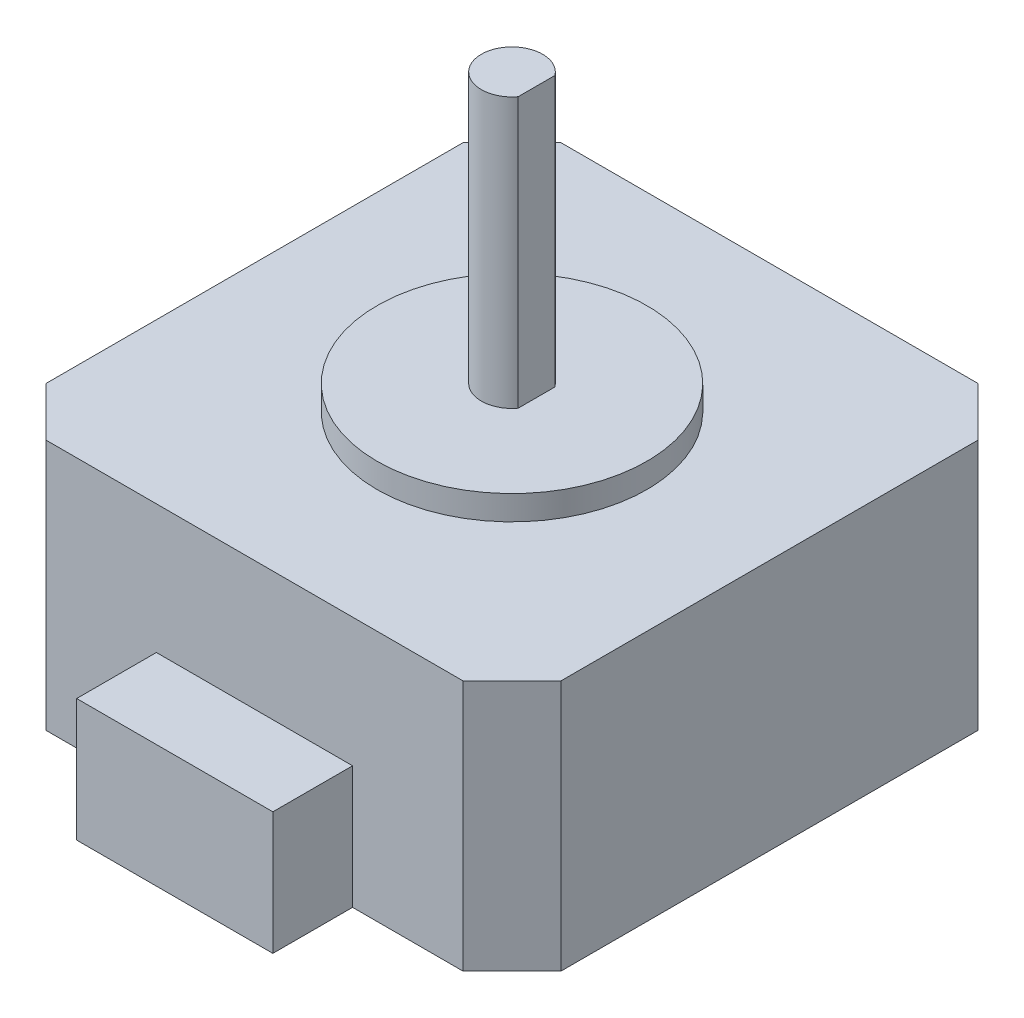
ISO-10303-21;
HEADER;
FILE_DESCRIPTION(('STEP AP214'),'2;1');
FILE_NAME('part.step','',(''),(''),'','','');
FILE_SCHEMA(('AUTOMOTIVE_DESIGN { 1 0 10303 214 1 1 1 1 }'));
ENDSEC;
DATA;
#1=APPLICATION_CONTEXT('core data for automotive mechanical design processes');
#2=APPLICATION_PROTOCOL_DEFINITION('international standard','automotive_design',2000,#1);
#3=PRODUCT_CONTEXT('',#1,'mechanical');
#4=PRODUCT('Part','Part','',(#3));
#5=PRODUCT_RELATED_PRODUCT_CATEGORY('part','',(#4));
#6=PRODUCT_DEFINITION_FORMATION('','',#4);
#7=PRODUCT_DEFINITION_CONTEXT('part definition',#1,'design');
#8=PRODUCT_DEFINITION('design','',#6,#7);
#9=PRODUCT_DEFINITION_SHAPE('','',#8);
#10=(LENGTH_UNIT() NAMED_UNIT(*) SI_UNIT(.MILLI.,.METRE.));
#11=(NAMED_UNIT(*) PLANE_ANGLE_UNIT() SI_UNIT($,.RADIAN.));
#12=(NAMED_UNIT(*) SI_UNIT($,.STERADIAN.) SOLID_ANGLE_UNIT());
#13=UNCERTAINTY_MEASURE_WITH_UNIT(LENGTH_MEASURE(1.E-05),#10,'distance_accuracy_value','');
#14=(GEOMETRIC_REPRESENTATION_CONTEXT(3) GLOBAL_UNCERTAINTY_ASSIGNED_CONTEXT((#13)) GLOBAL_UNIT_ASSIGNED_CONTEXT((#10,
#11,#12)) REPRESENTATION_CONTEXT('',''));
#15=CARTESIAN_POINT('',(0.,0.,0.));
#16=DIRECTION('',(0.,0.,1.));
#17=DIRECTION('',(1.,0.,0.));
#18=AXIS2_PLACEMENT_3D('',#15,#16,#17);
#19=CARTESIAN_POINT('',(17.,20.5,21.));
#20=DIRECTION('',(0.,0.,-1.));
#21=DIRECTION('',(-1.,0.,0.));
#22=AXIS2_PLACEMENT_3D('',#19,#20,#21);
#23=PLANE('',#22);
#24=DIRECTION('',(0.,-1.,0.));
#25=VECTOR('',#24,1.);
#26=CARTESIAN_POINT('',(-8.,10.,21.));
#27=LINE('',#26,#25);
#28=CARTESIAN_POINT('',(-8.,10.,21.));
#29=VERTEX_POINT('',#28);
#30=CARTESIAN_POINT('',(-8.,0.,21.));
#31=VERTEX_POINT('',#30);
#32=EDGE_CURVE('E189',#29,#31,#27,.T.);
#33=ORIENTED_EDGE('',*,*,#32,.F.);
#34=DIRECTION('',(1.,0.,0.));
#35=VECTOR('',#34,1.);
#36=CARTESIAN_POINT('',(-8.,10.,21.));
#37=LINE('',#36,#35);
#38=CARTESIAN_POINT('',(8.,10.,21.));
#39=VERTEX_POINT('',#38);
#40=EDGE_CURVE('E157',#29,#39,#37,.T.);
#41=ORIENTED_EDGE('',*,*,#40,.T.);
#42=DIRECTION('',(0.,-1.,0.));
#43=VECTOR('',#42,1.);
#44=CARTESIAN_POINT('',(8.,10.,21.));
#45=LINE('',#44,#43);
#46=CARTESIAN_POINT('',(8.,0.,21.));
#47=VERTEX_POINT('',#46);
#48=EDGE_CURVE('E170',#39,#47,#45,.T.);
#49=ORIENTED_EDGE('',*,*,#48,.T.);
#50=DIRECTION('',(1.,0.,0.));
#51=VECTOR('',#50,1.);
#52=CARTESIAN_POINT('',(17.,0.,21.));
#53=LINE('',#52,#51);
#54=CARTESIAN_POINT('',(17.,0.,21.));
#55=VERTEX_POINT('',#54);
#56=EDGE_CURVE('E257',#47,#55,#53,.T.);
#57=ORIENTED_EDGE('',*,*,#56,.T.);
#58=DIRECTION('',(0.,-1.,0.));
#59=VECTOR('',#58,1.);
#60=CARTESIAN_POINT('',(17.,20.5,21.));
#61=LINE('',#60,#59);
#62=CARTESIAN_POINT('',(17.,20.5,21.));
#63=VERTEX_POINT('',#62);
#64=EDGE_CURVE('E281',#63,#55,#61,.T.);
#65=ORIENTED_EDGE('',*,*,#64,.F.);
#66=DIRECTION('',(1.,0.,0.));
#67=VECTOR('',#66,1.);
#68=CARTESIAN_POINT('',(17.,20.5,21.));
#69=LINE('',#68,#67);
#70=CARTESIAN_POINT('',(-17.,20.5,21.));
#71=VERTEX_POINT('',#70);
#72=EDGE_CURVE('E232',#71,#63,#69,.T.);
#73=ORIENTED_EDGE('',*,*,#72,.F.);
#74=DIRECTION('',(0.,-1.,0.));
#75=VECTOR('',#74,1.);
#76=CARTESIAN_POINT('',(-17.,20.5,21.));
#77=LINE('',#76,#75);
#78=CARTESIAN_POINT('',(-17.,0.,21.));
#79=VERTEX_POINT('',#78);
#80=EDGE_CURVE('E285',#71,#79,#77,.T.);
#81=ORIENTED_EDGE('',*,*,#80,.T.);
#82=EDGE_CURVE('E258',#79,#31,#53,.T.);
#83=ORIENTED_EDGE('',*,*,#82,.T.);
#84=EDGE_LOOP('',(#33,#41,#49,#57,#65,#73,#81,#83));
#85=FACE_BOUND('',#84,.T.);
#86=ADVANCED_FACE('F45',(#85),#23,.F.);
#87=CARTESIAN_POINT('',(17.,20.5,-21.));
#88=DIRECTION('',(0.,0.,1.));
#89=DIRECTION('',(1.,0.,0.));
#90=AXIS2_PLACEMENT_3D('',#87,#88,#89);
#91=PLANE('',#90);
#92=DIRECTION('',(-1.,0.,0.));
#93=VECTOR('',#92,1.);
#94=CARTESIAN_POINT('',(17.,0.,-21.));
#95=LINE('',#94,#93);
#96=CARTESIAN_POINT('',(17.,0.,-21.));
#97=VERTEX_POINT('',#96);
#98=CARTESIAN_POINT('',(-17.,0.,-21.));
#99=VERTEX_POINT('',#98);
#100=EDGE_CURVE('E216',#97,#99,#95,.T.);
#101=ORIENTED_EDGE('',*,*,#100,.T.);
#102=DIRECTION('',(0.,-1.,0.));
#103=VECTOR('',#102,1.);
#104=CARTESIAN_POINT('',(-17.,20.5,-21.));
#105=LINE('',#104,#103);
#106=CARTESIAN_POINT('',(-17.,20.5,-21.));
#107=VERTEX_POINT('',#106);
#108=EDGE_CURVE('E49',#107,#99,#105,.T.);
#109=ORIENTED_EDGE('',*,*,#108,.F.);
#110=DIRECTION('',(-1.,0.,0.));
#111=VECTOR('',#110,1.);
#112=CARTESIAN_POINT('',(17.,20.5,-21.));
#113=LINE('',#112,#111);
#114=CARTESIAN_POINT('',(17.,20.5,-21.));
#115=VERTEX_POINT('',#114);
#116=EDGE_CURVE('E218',#115,#107,#113,.T.);
#117=ORIENTED_EDGE('',*,*,#116,.F.);
#118=DIRECTION('',(0.,-1.,0.));
#119=VECTOR('',#118,1.);
#120=CARTESIAN_POINT('',(17.,20.5,-21.));
#121=LINE('',#120,#119);
#122=EDGE_CURVE('E244',#115,#97,#121,.T.);
#123=ORIENTED_EDGE('',*,*,#122,.T.);
#124=EDGE_LOOP('',(#101,#109,#117,#123));
#125=FACE_BOUND('',#124,.T.);
#126=ADVANCED_FACE('F47',(#125),#91,.F.);
#127=CARTESIAN_POINT('',(-17.,20.5,-21.));
#128=DIRECTION('',(0.707106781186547,0.,0.707106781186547));
#129=DIRECTION('',(0.707106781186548,0.,-0.707106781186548));
#130=AXIS2_PLACEMENT_3D('',#127,#128,#129);
#131=PLANE('',#130);
#132=DIRECTION('',(-0.707106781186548,0.,0.707106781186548));
#133=VECTOR('',#132,1.);
#134=CARTESIAN_POINT('',(-17.,0.,-21.));
#135=LINE('',#134,#133);
#136=CARTESIAN_POINT('',(-21.,0.,-17.));
#137=VERTEX_POINT('',#136);
#138=EDGE_CURVE('E248',#99,#137,#135,.T.);
#139=ORIENTED_EDGE('',*,*,#138,.T.);
#140=DIRECTION('',(0.,-1.,0.));
#141=VECTOR('',#140,1.);
#142=CARTESIAN_POINT('',(-21.,20.5,-17.));
#143=LINE('',#142,#141);
#144=CARTESIAN_POINT('',(-21.,20.5,-17.));
#145=VERTEX_POINT('',#144);
#146=EDGE_CURVE('E292',#145,#137,#143,.T.);
#147=ORIENTED_EDGE('',*,*,#146,.F.);
#148=DIRECTION('',(-0.707106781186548,0.,0.707106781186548));
#149=VECTOR('',#148,1.);
#150=CARTESIAN_POINT('',(-17.,20.5,-21.));
#151=LINE('',#150,#149);
#152=EDGE_CURVE('E222',#107,#145,#151,.T.);
#153=ORIENTED_EDGE('',*,*,#152,.F.);
#154=ORIENTED_EDGE('',*,*,#108,.T.);
#155=EDGE_LOOP('',(#139,#147,#153,#154));
#156=FACE_BOUND('',#155,.T.);
#157=ADVANCED_FACE('F303',(#156),#131,.F.);
#158=CARTESIAN_POINT('',(-21.,20.5,17.));
#159=DIRECTION('',(1.,0.,0.));
#160=DIRECTION('',(0.,0.,-1.));
#161=AXIS2_PLACEMENT_3D('',#158,#159,#160);
#162=PLANE('',#161);
#163=DIRECTION('',(0.,0.,1.));
#164=VECTOR('',#163,1.);
#165=CARTESIAN_POINT('',(-21.,0.,17.));
#166=LINE('',#165,#164);
#167=CARTESIAN_POINT('',(-21.,0.,17.));
#168=VERTEX_POINT('',#167);
#169=EDGE_CURVE('E251',#137,#168,#166,.T.);
#170=ORIENTED_EDGE('',*,*,#169,.T.);
#171=DIRECTION('',(0.,-1.,0.));
#172=VECTOR('',#171,1.);
#173=CARTESIAN_POINT('',(-21.,20.5,17.));
#174=LINE('',#173,#172);
#175=CARTESIAN_POINT('',(-21.,20.5,17.));
#176=VERTEX_POINT('',#175);
#177=EDGE_CURVE('E289',#176,#168,#174,.T.);
#178=ORIENTED_EDGE('',*,*,#177,.F.);
#179=DIRECTION('',(0.,0.,1.));
#180=VECTOR('',#179,1.);
#181=CARTESIAN_POINT('',(-21.,20.5,17.));
#182=LINE('',#181,#180);
#183=EDGE_CURVE('E226',#145,#176,#182,.T.);
#184=ORIENTED_EDGE('',*,*,#183,.F.);
#185=ORIENTED_EDGE('',*,*,#146,.T.);
#186=EDGE_LOOP('',(#170,#178,#184,#185));
#187=FACE_BOUND('',#186,.T.);
#188=ADVANCED_FACE('F315',(#187),#162,.F.);
#189=CARTESIAN_POINT('',(-17.,20.5,21.));
#190=DIRECTION('',(0.707106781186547,0.,-0.707106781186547));
#191=DIRECTION('',(-0.707106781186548,0.,-0.707106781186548));
#192=AXIS2_PLACEMENT_3D('',#189,#190,#191);
#193=PLANE('',#192);
#194=DIRECTION('',(0.707106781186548,0.,0.707106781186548));
#195=VECTOR('',#194,1.);
#196=CARTESIAN_POINT('',(-17.,0.,21.));
#197=LINE('',#196,#195);
#198=EDGE_CURVE('E254',#168,#79,#197,.T.);
#199=ORIENTED_EDGE('',*,*,#198,.T.);
#200=ORIENTED_EDGE('',*,*,#80,.F.);
#201=DIRECTION('',(0.707106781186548,0.,0.707106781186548));
#202=VECTOR('',#201,1.);
#203=CARTESIAN_POINT('',(-17.,20.5,21.));
#204=LINE('',#203,#202);
#205=EDGE_CURVE('E229',#176,#71,#204,.T.);
#206=ORIENTED_EDGE('',*,*,#205,.F.);
#207=ORIENTED_EDGE('',*,*,#177,.T.);
#208=EDGE_LOOP('',(#199,#200,#206,#207));
#209=FACE_BOUND('',#208,.T.);
#210=ADVANCED_FACE('F318',(#209),#193,.F.);
#211=CARTESIAN_POINT('',(21.,20.5,17.));
#212=DIRECTION('',(-0.707106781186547,0.,-0.707106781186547));
#213=DIRECTION('',(-0.707106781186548,0.,0.707106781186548));
#214=AXIS2_PLACEMENT_3D('',#211,#212,#213);
#215=PLANE('',#214);
#216=DIRECTION('',(0.707106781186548,0.,-0.707106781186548));
#217=VECTOR('',#216,1.);
#218=CARTESIAN_POINT('',(21.,0.,17.));
#219=LINE('',#218,#217);
#220=CARTESIAN_POINT('',(21.,0.,17.));
#221=VERTEX_POINT('',#220);
#222=EDGE_CURVE('E262',#55,#221,#219,.T.);
#223=ORIENTED_EDGE('',*,*,#222,.T.);
#224=DIRECTION('',(0.,-1.,0.));
#225=VECTOR('',#224,1.);
#226=CARTESIAN_POINT('',(21.,20.5,17.));
#227=LINE('',#226,#225);
#228=CARTESIAN_POINT('',(21.,20.5,17.));
#229=VERTEX_POINT('',#228);
#230=EDGE_CURVE('E277',#229,#221,#227,.T.);
#231=ORIENTED_EDGE('',*,*,#230,.F.);
#232=DIRECTION('',(0.707106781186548,0.,-0.707106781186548));
#233=VECTOR('',#232,1.);
#234=CARTESIAN_POINT('',(21.,20.5,17.));
#235=LINE('',#234,#233);
#236=EDGE_CURVE('E235',#63,#229,#235,.T.);
#237=ORIENTED_EDGE('',*,*,#236,.F.);
#238=ORIENTED_EDGE('',*,*,#64,.T.);
#239=EDGE_LOOP('',(#223,#231,#237,#238));
#240=FACE_BOUND('',#239,.T.);
#241=ADVANCED_FACE('F335',(#240),#215,.F.);
#242=CARTESIAN_POINT('',(21.,20.5,17.));
#243=DIRECTION('',(-1.,0.,0.));
#244=DIRECTION('',(0.,0.,1.));
#245=AXIS2_PLACEMENT_3D('',#242,#243,#244);
#246=PLANE('',#245);
#247=DIRECTION('',(0.,0.,-1.));
#248=VECTOR('',#247,1.);
#249=CARTESIAN_POINT('',(21.,0.,17.));
#250=LINE('',#249,#248);
#251=CARTESIAN_POINT('',(21.,0.,-17.));
#252=VERTEX_POINT('',#251);
#253=EDGE_CURVE('E265',#221,#252,#250,.T.);
#254=ORIENTED_EDGE('',*,*,#253,.T.);
#255=DIRECTION('',(0.,-1.,0.));
#256=VECTOR('',#255,1.);
#257=CARTESIAN_POINT('',(21.,20.5,-17.));
#258=LINE('',#257,#256);
#259=CARTESIAN_POINT('',(21.,20.5,-17.));
#260=VERTEX_POINT('',#259);
#261=EDGE_CURVE('E273',#260,#252,#258,.T.);
#262=ORIENTED_EDGE('',*,*,#261,.F.);
#263=DIRECTION('',(0.,0.,-1.));
#264=VECTOR('',#263,1.);
#265=CARTESIAN_POINT('',(21.,20.5,17.));
#266=LINE('',#265,#264);
#267=EDGE_CURVE('E238',#229,#260,#266,.T.);
#268=ORIENTED_EDGE('',*,*,#267,.F.);
#269=ORIENTED_EDGE('',*,*,#230,.T.);
#270=EDGE_LOOP('',(#254,#262,#268,#269));
#271=FACE_BOUND('',#270,.T.);
#272=ADVANCED_FACE('F330',(#271),#246,.F.);
#273=CARTESIAN_POINT('',(21.,20.5,-17.));
#274=DIRECTION('',(-0.707106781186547,0.,0.707106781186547));
#275=DIRECTION('',(0.707106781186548,0.,0.707106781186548));
#276=AXIS2_PLACEMENT_3D('',#273,#274,#275);
#277=PLANE('',#276);
#278=DIRECTION('',(-0.707106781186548,0.,-0.707106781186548));
#279=VECTOR('',#278,1.);
#280=CARTESIAN_POINT('',(21.,0.,-17.));
#281=LINE('',#280,#279);
#282=EDGE_CURVE('E223',#252,#97,#281,.T.);
#283=ORIENTED_EDGE('',*,*,#282,.T.);
#284=ORIENTED_EDGE('',*,*,#122,.F.);
#285=DIRECTION('',(-0.707106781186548,0.,-0.707106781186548));
#286=VECTOR('',#285,1.);
#287=CARTESIAN_POINT('',(21.,20.5,-17.));
#288=LINE('',#287,#286);
#289=EDGE_CURVE('E241',#260,#115,#288,.T.);
#290=ORIENTED_EDGE('',*,*,#289,.F.);
#291=ORIENTED_EDGE('',*,*,#261,.T.);
#292=EDGE_LOOP('',(#283,#284,#290,#291));
#293=FACE_BOUND('',#292,.T.);
#294=ADVANCED_FACE('F328',(#293),#277,.F.);
#295=CARTESIAN_POINT('',(0.,20.5,0.));
#296=DIRECTION('',(0.,-1.,0.));
#297=DIRECTION('',(0.,0.,-1.));
#298=AXIS2_PLACEMENT_3D('',#295,#296,#297);
#299=PLANE('',#298);
#300=CARTESIAN_POINT('',(0.,20.5,0.));
#301=DIRECTION('',(0.,1.,0.));
#302=DIRECTION('',(0.,0.,1.));
#303=AXIS2_PLACEMENT_3D('',#300,#301,#302);
#304=CIRCLE('',#303,11.);
#305=CARTESIAN_POINT('',(0.,20.5,11.));
#306=VERTEX_POINT('',#305);
#307=EDGE_CURVE('E11',#306,#306,#304,.T.);
#308=ORIENTED_EDGE('',*,*,#307,.F.);
#309=EDGE_LOOP('',(#308));
#310=FACE_BOUND('',#309,.T.);
#311=ORIENTED_EDGE('',*,*,#116,.T.);
#312=ORIENTED_EDGE('',*,*,#152,.T.);
#313=ORIENTED_EDGE('',*,*,#183,.T.);
#314=ORIENTED_EDGE('',*,*,#205,.T.);
#315=ORIENTED_EDGE('',*,*,#72,.T.);
#316=ORIENTED_EDGE('',*,*,#236,.T.);
#317=ORIENTED_EDGE('',*,*,#267,.T.);
#318=ORIENTED_EDGE('',*,*,#289,.T.);
#319=EDGE_LOOP('',(#311,#312,#313,#314,#315,#316,#317,#318));
#320=FACE_BOUND('',#319,.T.);
#321=ADVANCED_FACE('F322',(#310,#320),#299,.F.);
#322=CARTESIAN_POINT('',(0.,0.,0.));
#323=DIRECTION('',(0.,-1.,0.));
#324=DIRECTION('',(0.,0.,-1.));
#325=AXIS2_PLACEMENT_3D('',#322,#323,#324);
#326=PLANE('',#325);
#327=ORIENTED_EDGE('',*,*,#100,.F.);
#328=ORIENTED_EDGE('',*,*,#282,.F.);
#329=ORIENTED_EDGE('',*,*,#253,.F.);
#330=ORIENTED_EDGE('',*,*,#222,.F.);
#331=ORIENTED_EDGE('',*,*,#56,.F.);
#332=DIRECTION('',(0.,0.,1.));
#333=VECTOR('',#332,1.);
#334=CARTESIAN_POINT('',(8.,0.,27.5));
#335=LINE('',#334,#333);
#336=CARTESIAN_POINT('',(8.,0.,27.5));
#337=VERTEX_POINT('',#336);
#338=EDGE_CURVE('E62',#47,#337,#335,.T.);
#339=ORIENTED_EDGE('',*,*,#338,.T.);
#340=DIRECTION('',(-1.,0.,0.));
#341=VECTOR('',#340,1.);
#342=CARTESIAN_POINT('',(-8.,0.,27.5));
#343=LINE('',#342,#341);
#344=CARTESIAN_POINT('',(-8.,0.,27.5));
#345=VERTEX_POINT('',#344);
#346=EDGE_CURVE('E153',#337,#345,#343,.T.);
#347=ORIENTED_EDGE('',*,*,#346,.T.);
#348=DIRECTION('',(0.,0.,-1.));
#349=VECTOR('',#348,1.);
#350=CARTESIAN_POINT('',(-8.,0.,27.5));
#351=LINE('',#350,#349);
#352=EDGE_CURVE('E172',#345,#31,#351,.T.);
#353=ORIENTED_EDGE('',*,*,#352,.T.);
#354=ORIENTED_EDGE('',*,*,#82,.F.);
#355=ORIENTED_EDGE('',*,*,#198,.F.);
#356=ORIENTED_EDGE('',*,*,#169,.F.);
#357=ORIENTED_EDGE('',*,*,#138,.F.);
#358=EDGE_LOOP('',(#327,#328,#329,#330,#331,#339,#347,#353,#354,#355,#356,#357));
#359=FACE_BOUND('',#358,.T.);
#360=ADVANCED_FACE('F310',(#359),#326,.T.);
#361=CARTESIAN_POINT('',(0.,22.5,0.));
#362=DIRECTION('',(0.,-1.,0.));
#363=DIRECTION('',(0.,0.,-1.));
#364=AXIS2_PLACEMENT_3D('',#361,#362,#363);
#365=CYLINDRICAL_SURFACE('',#364,11.);
#366=CARTESIAN_POINT('',(0.,22.5,0.));
#367=DIRECTION('',(0.,1.,0.));
#368=DIRECTION('',(0.,0.,1.));
#369=AXIS2_PLACEMENT_3D('',#366,#367,#368);
#370=CIRCLE('',#369,11.);
#371=CARTESIAN_POINT('',(0.,22.5,11.));
#372=VERTEX_POINT('',#371);
#373=EDGE_CURVE('E213',#372,#372,#370,.T.);
#374=ORIENTED_EDGE('',*,*,#373,.F.);
#375=EDGE_LOOP('',(#374));
#376=FACE_BOUND('',#375,.T.);
#377=ORIENTED_EDGE('',*,*,#307,.T.);
#378=EDGE_LOOP('',(#377));
#379=FACE_BOUND('',#378,.T.);
#380=ADVANCED_FACE('F413',(#376,#379),#365,.T.);
#381=CARTESIAN_POINT('',(0.,22.5,0.));
#382=DIRECTION('',(0.,1.,0.));
#383=DIRECTION('',(0.,0.,1.));
#384=AXIS2_PLACEMENT_3D('',#381,#382,#383);
#385=PLANE('',#384);
#386=CARTESIAN_POINT('',(0.,22.5,0.));
#387=DIRECTION('',(0.,1.,0.));
#388=DIRECTION('',(0.,0.,1.));
#389=AXIS2_PLACEMENT_3D('',#386,#387,#388);
#390=CIRCLE('',#389,2.5);
#391=CARTESIAN_POINT('',(2.,22.5,-1.5));
#392=VERTEX_POINT('',#391);
#393=CARTESIAN_POINT('',(2.,22.5,1.5));
#394=VERTEX_POINT('',#393);
#395=EDGE_CURVE('E188',#392,#394,#390,.T.);
#396=ORIENTED_EDGE('',*,*,#395,.F.);
#397=DIRECTION('',(0.,0.,-1.));
#398=VECTOR('',#397,1.);
#399=CARTESIAN_POINT('',(2.,22.5,-1.5));
#400=LINE('',#399,#398);
#401=EDGE_CURVE('E69',#394,#392,#400,.T.);
#402=ORIENTED_EDGE('',*,*,#401,.F.);
#403=EDGE_LOOP('',(#396,#402));
#404=FACE_BOUND('',#403,.T.);
#405=ORIENTED_EDGE('',*,*,#373,.T.);
#406=EDGE_LOOP('',(#405));
#407=FACE_BOUND('',#406,.T.);
#408=ADVANCED_FACE('F417',(#404,#407),#385,.T.);
#409=CARTESIAN_POINT('',(0.,44.5,0.));
#410=DIRECTION('',(0.,-1.,0.));
#411=DIRECTION('',(0.,0.,-1.));
#412=AXIS2_PLACEMENT_3D('',#409,#410,#411);
#413=CYLINDRICAL_SURFACE('',#412,2.5);
#414=ORIENTED_EDGE('',*,*,#395,.T.);
#415=DIRECTION('',(0.,-1.,0.));
#416=VECTOR('',#415,1.);
#417=CARTESIAN_POINT('',(2.,44.5,1.5));
#418=LINE('',#417,#416);
#419=CARTESIAN_POINT('',(2.,44.5,1.5));
#420=VERTEX_POINT('',#419);
#421=EDGE_CURVE('E210',#420,#394,#418,.T.);
#422=ORIENTED_EDGE('',*,*,#421,.F.);
#423=CARTESIAN_POINT('',(0.,44.5,0.));
#424=DIRECTION('',(0.,1.,0.));
#425=DIRECTION('',(0.,0.,1.));
#426=AXIS2_PLACEMENT_3D('',#423,#424,#425);
#427=CIRCLE('',#426,2.5);
#428=CARTESIAN_POINT('',(2.,44.5,-1.5));
#429=VERTEX_POINT('',#428);
#430=EDGE_CURVE('E194',#429,#420,#427,.T.);
#431=ORIENTED_EDGE('',*,*,#430,.F.);
#432=DIRECTION('',(0.,-1.,0.));
#433=VECTOR('',#432,1.);
#434=CARTESIAN_POINT('',(2.,44.5,-1.5));
#435=LINE('',#434,#433);
#436=EDGE_CURVE('E201',#429,#392,#435,.T.);
#437=ORIENTED_EDGE('',*,*,#436,.T.);
#438=EDGE_LOOP('',(#414,#422,#431,#437));
#439=FACE_BOUND('',#438,.T.);
#440=ADVANCED_FACE('F426',(#439),#413,.T.);
#441=CARTESIAN_POINT('',(2.,44.5,-1.5));
#442=DIRECTION('',(-1.,0.,0.));
#443=DIRECTION('',(0.,0.,1.));
#444=AXIS2_PLACEMENT_3D('',#441,#442,#443);
#445=PLANE('',#444);
#446=ORIENTED_EDGE('',*,*,#401,.T.);
#447=ORIENTED_EDGE('',*,*,#436,.F.);
#448=DIRECTION('',(0.,0.,-1.));
#449=VECTOR('',#448,1.);
#450=CARTESIAN_POINT('',(2.,44.5,-1.5));
#451=LINE('',#450,#449);
#452=EDGE_CURVE('E198',#420,#429,#451,.T.);
#453=ORIENTED_EDGE('',*,*,#452,.F.);
#454=ORIENTED_EDGE('',*,*,#421,.T.);
#455=EDGE_LOOP('',(#446,#447,#453,#454));
#456=FACE_BOUND('',#455,.T.);
#457=ADVANCED_FACE('F434',(#456),#445,.F.);
#458=CARTESIAN_POINT('',(0.,44.5,0.));
#459=DIRECTION('',(0.,1.,0.));
#460=DIRECTION('',(0.,0.,1.));
#461=AXIS2_PLACEMENT_3D('',#458,#459,#460);
#462=PLANE('',#461);
#463=ORIENTED_EDGE('',*,*,#430,.T.);
#464=ORIENTED_EDGE('',*,*,#452,.T.);
#465=EDGE_LOOP('',(#463,#464));
#466=FACE_BOUND('',#465,.T.);
#467=ADVANCED_FACE('F350',(#466),#462,.T.);
#468=CARTESIAN_POINT('',(8.,10.,27.5));
#469=DIRECTION('',(1.,0.,0.));
#470=DIRECTION('',(0.,0.,-1.));
#471=AXIS2_PLACEMENT_3D('',#468,#469,#470);
#472=PLANE('',#471);
#473=ORIENTED_EDGE('',*,*,#338,.F.);
#474=ORIENTED_EDGE('',*,*,#48,.F.);
#475=DIRECTION('',(0.,0.,1.));
#476=VECTOR('',#475,1.);
#477=CARTESIAN_POINT('',(8.,10.,27.5));
#478=LINE('',#477,#476);
#479=CARTESIAN_POINT('',(8.,10.,27.5));
#480=VERTEX_POINT('',#479);
#481=EDGE_CURVE('E164',#39,#480,#478,.T.);
#482=ORIENTED_EDGE('',*,*,#481,.T.);
#483=DIRECTION('',(0.,-1.,0.));
#484=VECTOR('',#483,1.);
#485=CARTESIAN_POINT('',(8.,10.,27.5));
#486=LINE('',#485,#484);
#487=EDGE_CURVE('E148',#480,#337,#486,.T.);
#488=ORIENTED_EDGE('',*,*,#487,.T.);
#489=EDGE_LOOP('',(#473,#474,#482,#488));
#490=FACE_BOUND('',#489,.T.);
#491=ADVANCED_FACE('F169',(#490),#472,.T.);
#492=CARTESIAN_POINT('',(-8.,10.,27.5));
#493=DIRECTION('',(-1.,0.,0.));
#494=DIRECTION('',(0.,0.,1.));
#495=AXIS2_PLACEMENT_3D('',#492,#493,#494);
#496=PLANE('',#495);
#497=ORIENTED_EDGE('',*,*,#352,.F.);
#498=DIRECTION('',(0.,-1.,0.));
#499=VECTOR('',#498,1.);
#500=CARTESIAN_POINT('',(-8.,10.,27.5));
#501=LINE('',#500,#499);
#502=CARTESIAN_POINT('',(-8.,10.,27.5));
#503=VERTEX_POINT('',#502);
#504=EDGE_CURVE('E156',#503,#345,#501,.T.);
#505=ORIENTED_EDGE('',*,*,#504,.F.);
#506=DIRECTION('',(0.,0.,-1.));
#507=VECTOR('',#506,1.);
#508=CARTESIAN_POINT('',(-8.,10.,27.5));
#509=LINE('',#508,#507);
#510=EDGE_CURVE('E166',#503,#29,#509,.T.);
#511=ORIENTED_EDGE('',*,*,#510,.T.);
#512=ORIENTED_EDGE('',*,*,#32,.T.);
#513=EDGE_LOOP('',(#497,#505,#511,#512));
#514=FACE_BOUND('',#513,.T.);
#515=ADVANCED_FACE('F342',(#514),#496,.T.);
#516=CARTESIAN_POINT('',(-8.,10.,27.5));
#517=DIRECTION('',(0.,0.,1.));
#518=DIRECTION('',(1.,0.,0.));
#519=AXIS2_PLACEMENT_3D('',#516,#517,#518);
#520=PLANE('',#519);
#521=ORIENTED_EDGE('',*,*,#346,.F.);
#522=ORIENTED_EDGE('',*,*,#487,.F.);
#523=DIRECTION('',(-1.,0.,0.));
#524=VECTOR('',#523,1.);
#525=CARTESIAN_POINT('',(-8.,10.,27.5));
#526=LINE('',#525,#524);
#527=EDGE_CURVE('E151',#480,#503,#526,.T.);
#528=ORIENTED_EDGE('',*,*,#527,.T.);
#529=ORIENTED_EDGE('',*,*,#504,.T.);
#530=EDGE_LOOP('',(#521,#522,#528,#529));
#531=FACE_BOUND('',#530,.T.);
#532=ADVANCED_FACE('F150',(#531),#520,.T.);
#533=CARTESIAN_POINT('',(0.,10.,0.));
#534=DIRECTION('',(0.,-1.,0.));
#535=DIRECTION('',(0.,0.,-1.));
#536=AXIS2_PLACEMENT_3D('',#533,#534,#535);
#537=PLANE('',#536);
#538=ORIENTED_EDGE('',*,*,#481,.F.);
#539=ORIENTED_EDGE('',*,*,#40,.F.);
#540=ORIENTED_EDGE('',*,*,#510,.F.);
#541=ORIENTED_EDGE('',*,*,#527,.F.);
#542=EDGE_LOOP('',(#538,#539,#540,#541));
#543=FACE_BOUND('',#542,.T.);
#544=ADVANCED_FACE('F162',(#543),#537,.F.);
#545=CLOSED_SHELL('',(#86,#126,#157,#188,#210,#241,#272,#294,#321,#360,#380,#408,#440,#457,#467,
#491,#515,#532,#544));
#546=MANIFOLD_SOLID_BREP('B2',#545);
#547=ADVANCED_BREP_SHAPE_REPRESENTATION('',(#18,#546),#14);
#548=SHAPE_DEFINITION_REPRESENTATION(#9,#547);
ENDSEC;
END-ISO-10303-21;
